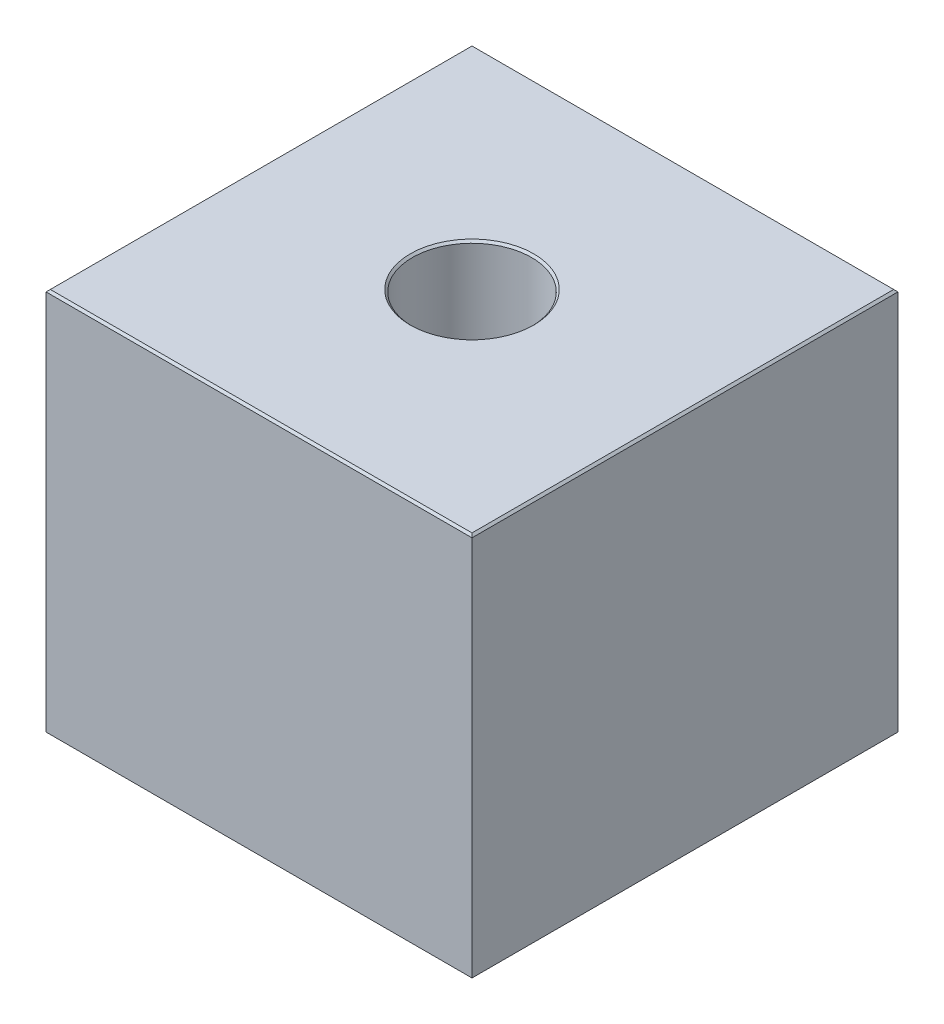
ISO-10303-21;
HEADER;
FILE_DESCRIPTION(('STEP AP214'),'2;1');
FILE_NAME('part.step','',(''),(''),'','','');
FILE_SCHEMA(('AUTOMOTIVE_DESIGN { 1 0 10303 214 1 1 1 1 }'));
ENDSEC;
DATA;
#1=APPLICATION_CONTEXT('core data for automotive mechanical design processes');
#2=APPLICATION_PROTOCOL_DEFINITION('international standard','automotive_design',2000,#1);
#3=PRODUCT_CONTEXT('',#1,'mechanical');
#4=PRODUCT('Part','Part','',(#3));
#5=PRODUCT_RELATED_PRODUCT_CATEGORY('part','',(#4));
#6=PRODUCT_DEFINITION_FORMATION('','',#4);
#7=PRODUCT_DEFINITION_CONTEXT('part definition',#1,'design');
#8=PRODUCT_DEFINITION('design','',#6,#7);
#9=PRODUCT_DEFINITION_SHAPE('','',#8);
#10=(LENGTH_UNIT() NAMED_UNIT(*) SI_UNIT(.MILLI.,.METRE.));
#11=(NAMED_UNIT(*) PLANE_ANGLE_UNIT() SI_UNIT($,.RADIAN.));
#12=(NAMED_UNIT(*) SI_UNIT($,.STERADIAN.) SOLID_ANGLE_UNIT());
#13=UNCERTAINTY_MEASURE_WITH_UNIT(LENGTH_MEASURE(1.E-05),#10,'distance_accuracy_value','');
#14=(GEOMETRIC_REPRESENTATION_CONTEXT(3) GLOBAL_UNCERTAINTY_ASSIGNED_CONTEXT((#13)) GLOBAL_UNIT_ASSIGNED_CONTEXT((#10,
#11,#12)) REPRESENTATION_CONTEXT('',''));
#15=CARTESIAN_POINT('',(0.,0.,0.));
#16=DIRECTION('',(0.,0.,1.));
#17=DIRECTION('',(1.,0.,0.));
#18=AXIS2_PLACEMENT_3D('',#15,#16,#17);
#19=CARTESIAN_POINT('',(0.,0.,100.));
#20=DIRECTION('',(1.,0.,0.));
#21=DIRECTION('',(0.,0.,-1.));
#22=AXIS2_PLACEMENT_3D('',#19,#20,#21);
#23=PLANE('',#22);
#24=DIRECTION('',(0.,-1.,0.));
#25=VECTOR('',#24,1.);
#26=CARTESIAN_POINT('',(0.,0.,100.));
#27=LINE('',#26,#25);
#28=CARTESIAN_POINT('',(0.,89.5,100.));
#29=VERTEX_POINT('',#28);
#30=CARTESIAN_POINT('',(0.,0.,100.));
#31=VERTEX_POINT('',#30);
#32=EDGE_CURVE('E84',#29,#31,#27,.T.);
#33=ORIENTED_EDGE('',*,*,#32,.F.);
#34=DIRECTION('',(0.,0.,-1.));
#35=VECTOR('',#34,1.);
#36=CARTESIAN_POINT('',(0.,89.5,100.));
#37=LINE('',#36,#35);
#38=CARTESIAN_POINT('',(0.,89.5,0.));
#39=VERTEX_POINT('',#38);
#40=EDGE_CURVE('E48',#29,#39,#37,.T.);
#41=ORIENTED_EDGE('',*,*,#40,.T.);
#42=DIRECTION('',(0.,-1.,0.));
#43=VECTOR('',#42,1.);
#44=CARTESIAN_POINT('',(0.,0.,0.));
#45=LINE('',#44,#43);
#46=CARTESIAN_POINT('',(0.,0.,0.));
#47=VERTEX_POINT('',#46);
#48=EDGE_CURVE('E101',#39,#47,#45,.T.);
#49=ORIENTED_EDGE('',*,*,#48,.T.);
#50=DIRECTION('',(0.,0.,-1.));
#51=VECTOR('',#50,1.);
#52=CARTESIAN_POINT('',(0.,0.,100.));
#53=LINE('',#52,#51);
#54=EDGE_CURVE('E95',#31,#47,#53,.T.);
#55=ORIENTED_EDGE('',*,*,#54,.F.);
#56=EDGE_LOOP('',(#33,#41,#49,#55));
#57=FACE_BOUND('',#56,.T.);
#58=ADVANCED_FACE('F31',(#57),#23,.F.);
#59=CARTESIAN_POINT('',(0.,0.,100.));
#60=DIRECTION('',(0.,1.,0.));
#61=DIRECTION('',(0.,0.,1.));
#62=AXIS2_PLACEMENT_3D('',#59,#60,#61);
#63=PLANE('',#62);
#64=CARTESIAN_POINT('',(50.,0.,50.));
#65=DIRECTION('',(0.,1.,0.));
#66=DIRECTION('',(0.,0.,1.));
#67=AXIS2_PLACEMENT_3D('',#64,#65,#66);
#68=CIRCLE('',#67,14.);
#69=CARTESIAN_POINT('',(50.,0.,64.));
#70=VERTEX_POINT('',#69);
#71=EDGE_CURVE('E135',#70,#70,#68,.T.);
#72=ORIENTED_EDGE('',*,*,#71,.T.);
#73=EDGE_LOOP('',(#72));
#74=FACE_BOUND('',#73,.T.);
#75=DIRECTION('',(1.,0.,0.));
#76=VECTOR('',#75,1.);
#77=CARTESIAN_POINT('',(0.,0.,0.));
#78=LINE('',#77,#76);
#79=CARTESIAN_POINT('',(100.,0.,0.));
#80=VERTEX_POINT('',#79);
#81=EDGE_CURVE('E143',#47,#80,#78,.T.);
#82=ORIENTED_EDGE('',*,*,#81,.T.);
#83=DIRECTION('',(0.,0.,-1.));
#84=VECTOR('',#83,1.);
#85=CARTESIAN_POINT('',(100.,0.,100.));
#86=LINE('',#85,#84);
#87=CARTESIAN_POINT('',(100.,0.,100.));
#88=VERTEX_POINT('',#87);
#89=EDGE_CURVE('E97',#88,#80,#86,.T.);
#90=ORIENTED_EDGE('',*,*,#89,.F.);
#91=DIRECTION('',(1.,0.,0.));
#92=VECTOR('',#91,1.);
#93=CARTESIAN_POINT('',(0.,0.,100.));
#94=LINE('',#93,#92);
#95=EDGE_CURVE('E87',#31,#88,#94,.T.);
#96=ORIENTED_EDGE('',*,*,#95,.F.);
#97=ORIENTED_EDGE('',*,*,#54,.T.);
#98=EDGE_LOOP('',(#82,#90,#96,#97));
#99=FACE_BOUND('',#98,.T.);
#100=ADVANCED_FACE('F94',(#74,#99),#63,.F.);
#101=CARTESIAN_POINT('',(100.,0.,100.));
#102=DIRECTION('',(-1.,0.,0.));
#103=DIRECTION('',(0.,0.,1.));
#104=AXIS2_PLACEMENT_3D('',#101,#102,#103);
#105=PLANE('',#104);
#106=DIRECTION('',(0.,1.,0.));
#107=VECTOR('',#106,1.);
#108=CARTESIAN_POINT('',(100.,0.,0.));
#109=LINE('',#108,#107);
#110=CARTESIAN_POINT('',(100.,89.5,0.));
#111=VERTEX_POINT('',#110);
#112=EDGE_CURVE('E90',#80,#111,#109,.T.);
#113=ORIENTED_EDGE('',*,*,#112,.T.);
#114=DIRECTION('',(0.,0.,1.));
#115=VECTOR('',#114,1.);
#116=CARTESIAN_POINT('',(100.,89.5,100.));
#117=LINE('',#116,#115);
#118=CARTESIAN_POINT('',(100.,89.5,100.));
#119=VERTEX_POINT('',#118);
#120=EDGE_CURVE('E119',#111,#119,#117,.T.);
#121=ORIENTED_EDGE('',*,*,#120,.T.);
#122=DIRECTION('',(0.,1.,0.));
#123=VECTOR('',#122,1.);
#124=CARTESIAN_POINT('',(100.,0.,100.));
#125=LINE('',#124,#123);
#126=EDGE_CURVE('E99',#88,#119,#125,.T.);
#127=ORIENTED_EDGE('',*,*,#126,.F.);
#128=ORIENTED_EDGE('',*,*,#89,.T.);
#129=EDGE_LOOP('',(#113,#121,#127,#128));
#130=FACE_BOUND('',#129,.T.);
#131=ADVANCED_FACE('F151',(#130),#105,.F.);
#132=CARTESIAN_POINT('',(0.,90.,100.));
#133=DIRECTION('',(0.,-1.,0.));
#134=DIRECTION('',(0.,0.,-1.));
#135=AXIS2_PLACEMENT_3D('',#132,#133,#134);
#136=PLANE('',#135);
#137=DIRECTION('',(1.,0.,0.));
#138=VECTOR('',#137,1.);
#139=CARTESIAN_POINT('',(0.,90.,99.5));
#140=LINE('',#139,#138);
#141=CARTESIAN_POINT('',(0.5,90.,99.5));
#142=VERTEX_POINT('',#141);
#143=CARTESIAN_POINT('',(99.5,90.,99.5));
#144=VERTEX_POINT('',#143);
#145=EDGE_CURVE('E114',#142,#144,#140,.T.);
#146=ORIENTED_EDGE('',*,*,#145,.T.);
#147=DIRECTION('',(0.,0.,-1.));
#148=VECTOR('',#147,1.);
#149=CARTESIAN_POINT('',(99.5,90.,100.));
#150=LINE('',#149,#148);
#151=CARTESIAN_POINT('',(99.5,90.,0.5));
#152=VERTEX_POINT('',#151);
#153=EDGE_CURVE('E116',#144,#152,#150,.T.);
#154=ORIENTED_EDGE('',*,*,#153,.T.);
#155=DIRECTION('',(-1.,0.,0.));
#156=VECTOR('',#155,1.);
#157=CARTESIAN_POINT('',(0.,90.,0.5));
#158=LINE('',#157,#156);
#159=CARTESIAN_POINT('',(0.5,90.,0.5));
#160=VERTEX_POINT('',#159);
#161=EDGE_CURVE('E106',#152,#160,#158,.T.);
#162=ORIENTED_EDGE('',*,*,#161,.T.);
#163=DIRECTION('',(0.,0.,1.));
#164=VECTOR('',#163,1.);
#165=CARTESIAN_POINT('',(0.5,90.,100.));
#166=LINE('',#165,#164);
#167=EDGE_CURVE('E112',#160,#142,#166,.T.);
#168=ORIENTED_EDGE('',*,*,#167,.T.);
#169=EDGE_LOOP('',(#146,#154,#162,#168));
#170=FACE_BOUND('',#169,.T.);
#171=CARTESIAN_POINT('',(50.,90.,50.));
#172=DIRECTION('',(0.,-1.,0.));
#173=DIRECTION('',(0.,0.,-1.));
#174=AXIS2_PLACEMENT_3D('',#171,#172,#173);
#175=CIRCLE('',#174,14.5);
#176=CARTESIAN_POINT('',(50.,90.,35.5));
#177=VERTEX_POINT('',#176);
#178=EDGE_CURVE('E103',#177,#177,#175,.T.);
#179=ORIENTED_EDGE('',*,*,#178,.T.);
#180=EDGE_LOOP('',(#179));
#181=FACE_BOUND('',#180,.T.);
#182=ADVANCED_FACE('F161',(#170,#181),#136,.F.);
#183=CARTESIAN_POINT('',(0.,90.,100.));
#184=DIRECTION('',(0.,0.,-1.));
#185=DIRECTION('',(-1.,0.,0.));
#186=AXIS2_PLACEMENT_3D('',#183,#184,#185);
#187=PLANE('',#186);
#188=ORIENTED_EDGE('',*,*,#126,.T.);
#189=DIRECTION('',(-1.,0.,0.));
#190=VECTOR('',#189,1.);
#191=CARTESIAN_POINT('',(0.,89.5,100.));
#192=LINE('',#191,#190);
#193=EDGE_CURVE('E56',#119,#29,#192,.T.);
#194=ORIENTED_EDGE('',*,*,#193,.T.);
#195=ORIENTED_EDGE('',*,*,#32,.T.);
#196=ORIENTED_EDGE('',*,*,#95,.T.);
#197=EDGE_LOOP('',(#188,#194,#195,#196));
#198=FACE_BOUND('',#197,.T.);
#199=ADVANCED_FACE('F86',(#198),#187,.F.);
#200=CARTESIAN_POINT('',(0.,90.,0.));
#201=DIRECTION('',(0.,0.,-1.));
#202=DIRECTION('',(-1.,0.,0.));
#203=AXIS2_PLACEMENT_3D('',#200,#201,#202);
#204=PLANE('',#203);
#205=ORIENTED_EDGE('',*,*,#48,.F.);
#206=DIRECTION('',(1.,0.,0.));
#207=VECTOR('',#206,1.);
#208=CARTESIAN_POINT('',(100.,89.5,0.));
#209=LINE('',#208,#207);
#210=EDGE_CURVE('E40',#39,#111,#209,.T.);
#211=ORIENTED_EDGE('',*,*,#210,.T.);
#212=ORIENTED_EDGE('',*,*,#112,.F.);
#213=ORIENTED_EDGE('',*,*,#81,.F.);
#214=EDGE_LOOP('',(#205,#211,#212,#213));
#215=FACE_BOUND('',#214,.T.);
#216=ADVANCED_FACE('F195',(#215),#204,.T.);
#217=CARTESIAN_POINT('',(50.,0.,50.));
#218=DIRECTION('',(0.,1.,0.));
#219=DIRECTION('',(0.,0.,1.));
#220=AXIS2_PLACEMENT_3D('',#217,#218,#219);
#221=CYLINDRICAL_SURFACE('',#220,14.);
#222=CARTESIAN_POINT('',(50.,89.5,50.));
#223=DIRECTION('',(0.,-1.,0.));
#224=DIRECTION('',(0.,0.,-1.));
#225=AXIS2_PLACEMENT_3D('',#222,#223,#224);
#226=CIRCLE('',#225,14.);
#227=CARTESIAN_POINT('',(50.,89.5,64.));
#228=VERTEX_POINT('',#227);
#229=EDGE_CURVE('E11',#228,#228,#226,.F.);
#230=CARTESIAN_POINT('',(50.,89.5,64.));
#231=CARTESIAN_POINT('',(50.,88.5677083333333,64.));
#232=CARTESIAN_POINT('',(50.,87.6354166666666,64.));
#233=CARTESIAN_POINT('',(50.,85.7708333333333,64.));
#234=CARTESIAN_POINT('',(50.,84.8385416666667,64.));
#235=CARTESIAN_POINT('',(50.,82.9739583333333,64.));
#236=CARTESIAN_POINT('',(50.,82.0416666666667,64.));
#237=CARTESIAN_POINT('',(50.,80.1770833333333,64.));
#238=CARTESIAN_POINT('',(50.,79.2447916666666,64.));
#239=CARTESIAN_POINT('',(50.,77.3802083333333,64.));
#240=CARTESIAN_POINT('',(50.,76.4479166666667,64.));
#241=CARTESIAN_POINT('',(50.,74.5833333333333,64.));
#242=CARTESIAN_POINT('',(50.,73.6510416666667,64.));
#243=CARTESIAN_POINT('',(50.,71.7864583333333,64.));
#244=CARTESIAN_POINT('',(50.,70.8541666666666,64.));
#245=CARTESIAN_POINT('',(50.,68.9895833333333,64.));
#246=CARTESIAN_POINT('',(50.,68.0572916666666,64.));
#247=CARTESIAN_POINT('',(50.,66.1927083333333,64.));
#248=CARTESIAN_POINT('',(50.,65.2604166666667,64.));
#249=CARTESIAN_POINT('',(50.,63.3958333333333,64.));
#250=CARTESIAN_POINT('',(50.,62.4635416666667,64.));
#251=CARTESIAN_POINT('',(50.,60.5989583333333,64.));
#252=CARTESIAN_POINT('',(50.,59.6666666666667,64.));
#253=CARTESIAN_POINT('',(50.,57.8020833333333,64.));
#254=CARTESIAN_POINT('',(50.,56.8697916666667,64.));
#255=CARTESIAN_POINT('',(50.,55.0052083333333,64.));
#256=CARTESIAN_POINT('',(50.,54.0729166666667,64.));
#257=CARTESIAN_POINT('',(50.,52.2083333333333,64.));
#258=CARTESIAN_POINT('',(50.,51.2760416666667,64.));
#259=CARTESIAN_POINT('',(50.,49.4114583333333,64.));
#260=CARTESIAN_POINT('',(50.,48.4791666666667,64.));
#261=CARTESIAN_POINT('',(50.,46.6145833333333,64.));
#262=CARTESIAN_POINT('',(50.,45.6822916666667,64.));
#263=CARTESIAN_POINT('',(50.,43.8177083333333,64.));
#264=CARTESIAN_POINT('',(50.,42.8854166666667,64.));
#265=CARTESIAN_POINT('',(50.,41.0208333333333,64.));
#266=CARTESIAN_POINT('',(50.,40.0885416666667,64.));
#267=CARTESIAN_POINT('',(50.,38.2239583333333,64.));
#268=CARTESIAN_POINT('',(50.,37.2916666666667,64.));
#269=CARTESIAN_POINT('',(50.,35.4270833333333,64.));
#270=CARTESIAN_POINT('',(50.,34.4947916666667,64.));
#271=CARTESIAN_POINT('',(50.,32.6302083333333,64.));
#272=CARTESIAN_POINT('',(50.,31.6979166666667,64.));
#273=CARTESIAN_POINT('',(50.,29.8333333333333,64.));
#274=CARTESIAN_POINT('',(50.,28.9010416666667,64.));
#275=CARTESIAN_POINT('',(50.,27.0364583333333,64.));
#276=CARTESIAN_POINT('',(50.,26.1041666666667,64.));
#277=CARTESIAN_POINT('',(50.,24.2395833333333,64.));
#278=CARTESIAN_POINT('',(50.,23.3072916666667,64.));
#279=CARTESIAN_POINT('',(50.,21.4427083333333,64.));
#280=CARTESIAN_POINT('',(50.,20.5104166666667,64.));
#281=CARTESIAN_POINT('',(50.,18.6458333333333,64.));
#282=CARTESIAN_POINT('',(50.,17.7135416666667,64.));
#283=CARTESIAN_POINT('',(50.,15.8489583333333,64.));
#284=CARTESIAN_POINT('',(50.,14.9166666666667,64.));
#285=CARTESIAN_POINT('',(50.,13.0520833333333,64.));
#286=CARTESIAN_POINT('',(50.,12.1197916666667,64.));
#287=CARTESIAN_POINT('',(50.,10.2552083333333,64.));
#288=CARTESIAN_POINT('',(50.,9.32291666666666,64.));
#289=CARTESIAN_POINT('',(50.,7.45833333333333,64.));
#290=CARTESIAN_POINT('',(50.,6.52604166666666,64.));
#291=CARTESIAN_POINT('',(50.,4.66145833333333,64.));
#292=CARTESIAN_POINT('',(50.,3.72916666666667,64.));
#293=CARTESIAN_POINT('',(50.,1.86458333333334,64.));
#294=CARTESIAN_POINT('',(50.,0.932291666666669,64.));
#295=CARTESIAN_POINT('',(50.,0.,64.));
#296=B_SPLINE_CURVE_WITH_KNOTS('',3,(#230,#231,#232,#233,#234,#235,#236,#237,#238,#239,#240,
#241,#242,#243,#244,#245,#246,#247,#248,#249,#250,#251,#252,#253,#254,#255,#256,#257,#258,#259,
#260,#261,#262,#263,#264,#265,#266,#267,#268,#269,#270,#271,#272,#273,#274,#275,#276,#277,#278,
#279,#280,#281,#282,#283,#284,#285,#286,#287,#288,#289,#290,#291,#292,#293,#294,#295),
.UNSPECIFIED.,.F.,.F.,(4,2,2,2,2,2,2,2,2,2,2,2,2,2,2,2,2,2,2,2,2,2,2,2,2,2,2,2,2,2,2,2,4),(0.,
2.796875,5.59374999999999,8.390625,11.1875,13.984375,16.78125,19.578125,22.375,25.171875,
27.96875,30.765625,33.5625,36.359375,39.15625,41.953125,44.75,47.546875,50.34375,53.140625,
55.9375,58.734375,61.53125,64.328125,67.125,69.921875,72.71875,75.515625,78.3125,81.109375,
83.90625,86.703125,89.5),.UNSPECIFIED.);
#297=EDGE_CURVE('BSEAM172',#228,#70,#296,.T.);
#298=ORIENTED_EDGE('',*,*,#229,.T.);
#299=ORIENTED_EDGE('',*,*,#71,.F.);
#300=ORIENTED_EDGE('',*,*,#297,.T.);
#301=ORIENTED_EDGE('',*,*,#297,.F.);
#302=EDGE_LOOP('',(#298,#300,#299,#301));
#303=FACE_BOUND('',#302,.T.);
#304=ADVANCED_FACE('F172',(#303),#221,.F.);
#305=CARTESIAN_POINT('',(0.,89.5,100.));
#306=DIRECTION('',(0.707106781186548,-0.707106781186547,0.));
#307=DIRECTION('',(0.707106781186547,0.707106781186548,0.));
#308=AXIS2_PLACEMENT_3D('',#305,#306,#307);
#309=PLANE('',#308);
#310=DIRECTION('',(-0.577350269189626,-0.577350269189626,-0.577350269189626));
#311=VECTOR('',#310,1.);
#312=CARTESIAN_POINT('',(0.333333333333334,89.8333333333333,0.333333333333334));
#313=LINE('',#312,#311);
#314=EDGE_CURVE('E128',#39,#160,#313,.F.);
#315=ORIENTED_EDGE('',*,*,#314,.F.);
#316=ORIENTED_EDGE('',*,*,#40,.F.);
#317=DIRECTION('',(0.577350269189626,0.577350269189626,-0.577350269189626));
#318=VECTOR('',#317,1.);
#319=CARTESIAN_POINT('',(0.,89.5,100.));
#320=LINE('',#319,#318);
#321=EDGE_CURVE('E35',#142,#29,#320,.F.);
#322=ORIENTED_EDGE('',*,*,#321,.F.);
#323=ORIENTED_EDGE('',*,*,#167,.F.);
#324=EDGE_LOOP('',(#315,#316,#322,#323));
#325=FACE_BOUND('',#324,.T.);
#326=ADVANCED_FACE('F165',(#325),#309,.F.);
#327=CARTESIAN_POINT('',(0.,89.5,100.));
#328=DIRECTION('',(0.,-0.707106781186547,-0.707106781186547));
#329=DIRECTION('',(0.,0.707106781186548,-0.707106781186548));
#330=AXIS2_PLACEMENT_3D('',#327,#328,#329);
#331=PLANE('',#330);
#332=ORIENTED_EDGE('',*,*,#321,.T.);
#333=ORIENTED_EDGE('',*,*,#193,.F.);
#334=DIRECTION('',(-0.577350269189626,0.577350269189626,-0.577350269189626));
#335=VECTOR('',#334,1.);
#336=CARTESIAN_POINT('',(66.6666666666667,122.833333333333,66.6666666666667));
#337=LINE('',#336,#335);
#338=EDGE_CURVE('E127',#144,#119,#337,.F.);
#339=ORIENTED_EDGE('',*,*,#338,.F.);
#340=ORIENTED_EDGE('',*,*,#145,.F.);
#341=EDGE_LOOP('',(#332,#333,#339,#340));
#342=FACE_BOUND('',#341,.T.);
#343=ADVANCED_FACE('F163',(#342),#331,.F.);
#344=CARTESIAN_POINT('',(0.,90.,0.5));
#345=DIRECTION('',(0.,0.707106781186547,-0.707106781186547));
#346=DIRECTION('',(0.,0.707106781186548,0.707106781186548));
#347=AXIS2_PLACEMENT_3D('',#344,#345,#346);
#348=PLANE('',#347);
#349=ORIENTED_EDGE('',*,*,#314,.T.);
#350=ORIENTED_EDGE('',*,*,#161,.F.);
#351=DIRECTION('',(-0.577350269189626,0.577350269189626,0.577350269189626));
#352=VECTOR('',#351,1.);
#353=CARTESIAN_POINT('',(66.3333333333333,123.166666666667,33.6666666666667));
#354=LINE('',#353,#352);
#355=EDGE_CURVE('E125',#111,#152,#354,.T.);
#356=ORIENTED_EDGE('',*,*,#355,.F.);
#357=ORIENTED_EDGE('',*,*,#210,.F.);
#358=EDGE_LOOP('',(#349,#350,#356,#357));
#359=FACE_BOUND('',#358,.T.);
#360=ADVANCED_FACE('F158',(#359),#348,.T.);
#361=CARTESIAN_POINT('',(99.5,90.,100.));
#362=DIRECTION('',(-0.707106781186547,-0.707106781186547,0.));
#363=DIRECTION('',(0.707106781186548,-0.707106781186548,0.));
#364=AXIS2_PLACEMENT_3D('',#361,#362,#363);
#365=PLANE('',#364);
#366=ORIENTED_EDGE('',*,*,#338,.T.);
#367=ORIENTED_EDGE('',*,*,#120,.F.);
#368=ORIENTED_EDGE('',*,*,#355,.T.);
#369=ORIENTED_EDGE('',*,*,#153,.F.);
#370=EDGE_LOOP('',(#366,#367,#368,#369));
#371=FACE_BOUND('',#370,.T.);
#372=ADVANCED_FACE('F155',(#371),#365,.F.);
#373=CARTESIAN_POINT('',(50.,89.5,50.));
#374=DIRECTION('',(0.,1.,0.));
#375=DIRECTION('',(0.,0.,1.));
#376=AXIS2_PLACEMENT_3D('',#373,#374,#375);
#377=CONICAL_SURFACE('',#376,14.,0.785398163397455);
#378=ORIENTED_EDGE('',*,*,#178,.F.);
#379=EDGE_LOOP('',(#378));
#380=FACE_BOUND('',#379,.T.);
#381=ORIENTED_EDGE('',*,*,#229,.F.);
#382=EDGE_LOOP('',(#381));
#383=FACE_BOUND('',#382,.T.);
#384=ADVANCED_FACE('F33',(#380,#383),#377,.F.);
#385=CLOSED_SHELL('',(#58,#100,#131,#182,#199,#216,#304,#326,#343,#360,#372,#384));
#386=MANIFOLD_SOLID_BREP('B2',#385);
#387=ADVANCED_BREP_SHAPE_REPRESENTATION('',(#18,#386),#14);
#388=SHAPE_DEFINITION_REPRESENTATION(#9,#387);
ENDSEC;
END-ISO-10303-21;
